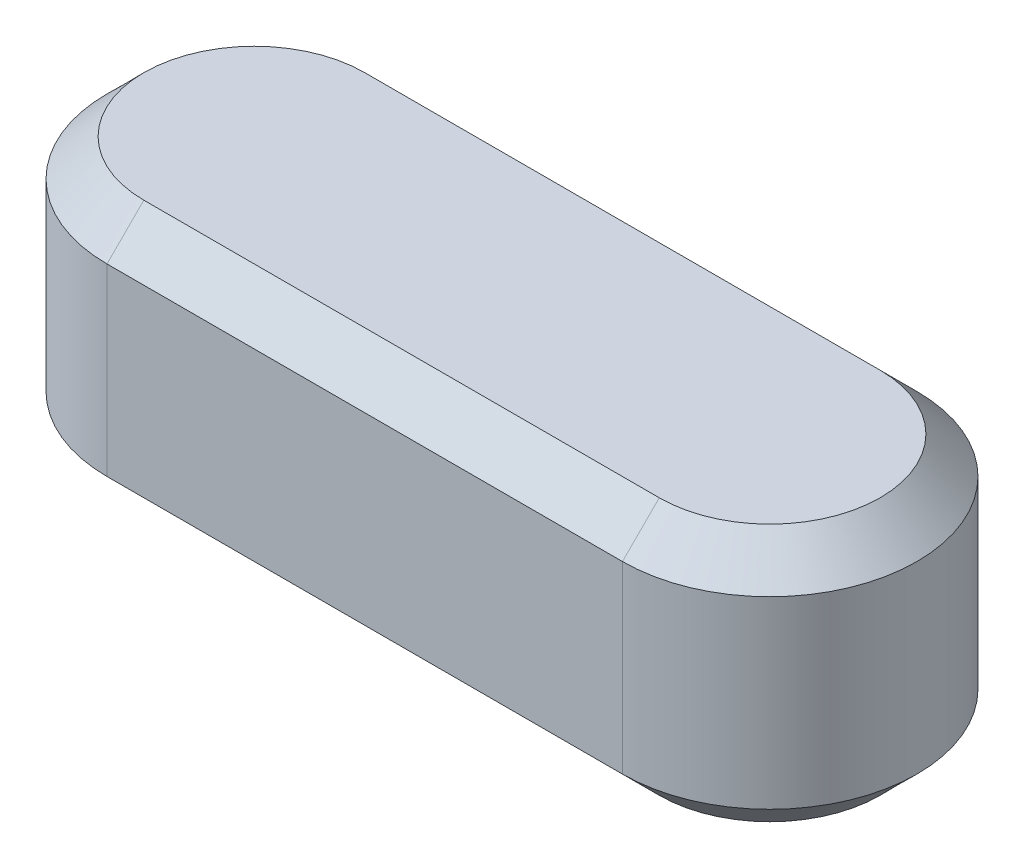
from build123d import *

# Parameters (mm, degrees)
AUFSATZ_LINEAR_AUSTRAGEN1_DEPTH = 7
FASE1_SIZE                      = 1


with BuildPart() as part:
    # Skizze2 → Aufsatz-Linear austragen1 (new body)
    with BuildSketch(Plane(origin=(0, 0, 0), x_dir=(1, 0, 0), z_dir=(0, 1, 0))):
        with BuildLine():
            Line((0, 4), (14, 4))
            ThreePointArc((14, 4), (18, 0), (14, -4))
            Line((14, -4), (0, -4))
            ThreePointArc((0, -4), (-4, 0), (0, 4))
        make_face()
    extrude(amount=AUFSATZ_LINEAR_AUSTRAGEN1_DEPTH)

    # Fase1
    fase1_edges = [part.edges().sort_by_distance(p)[0] for p in [
        (18, 7, 0),
        (7, 7, -4),
        (-4, 7, 0),
        (7, 0, -4),
        (18, 0, 0),
        (7, 0, 4),
        (-4, 0, 0),
        (7, 7, 4),
    ]]
    chamfer(fase1_edges, length=FASE1_SIZE)


solid = part.part
